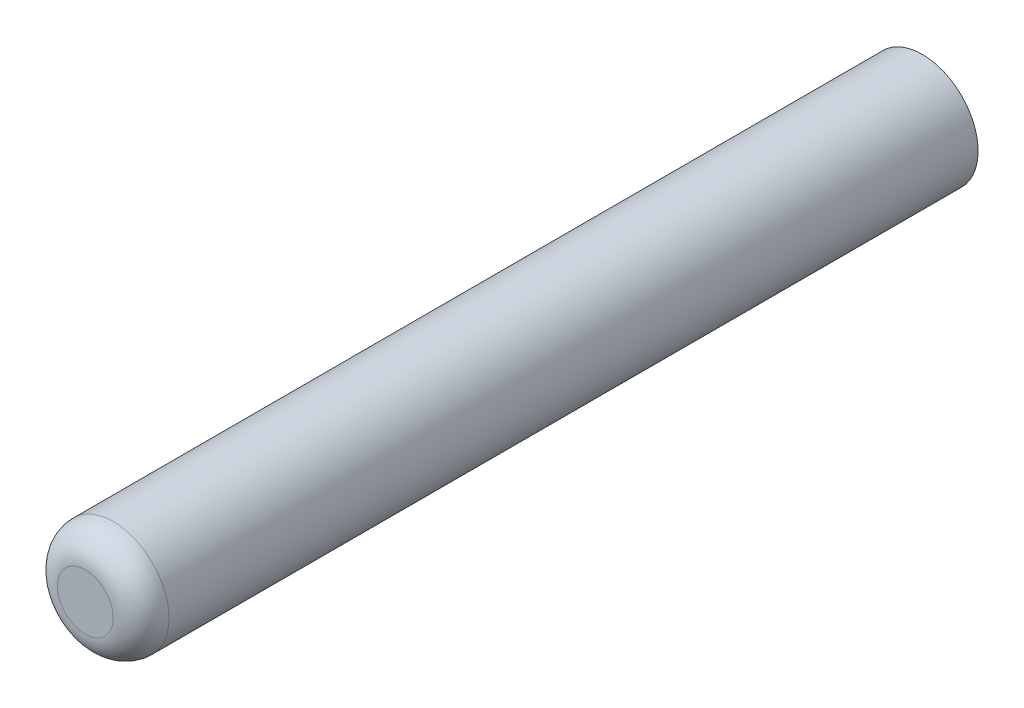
from build123d import *

# Parameters (mm, degrees)
ESQUISSE1_R            = 1
CYLINDRE_DE_BASE_DEPTH = 7.5
CONG_R                 = 0.5


with BuildPart() as part:
    # Esquisse1 → Cylindre de base (new, symmetric)
    with BuildSketch(Plane.XY):
        with Locations(Location((0, 0, 0), (0, 0, 180))):
            Circle(ESQUISSE1_R)
    extrude(amount=CYLINDRE_DE_BASE_DEPTH, both=True)

    # Cong
    cong_edges = [part.edges().sort_by_distance(p)[0] for p in [
        (1, 0, 7.5),
    ]]
    fillet(cong_edges, radius=CONG_R)


solid = part.part
